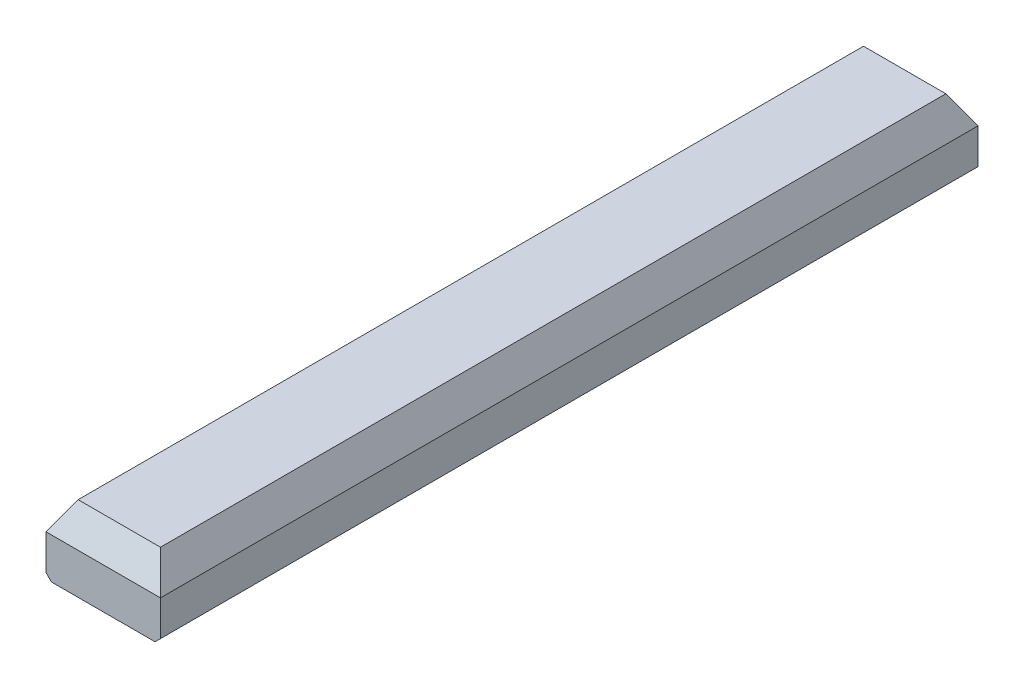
from build123d import *

# Parameters (mm, degrees)
SKETCH2_W           = 189.8015
SKETCH2_H           = 316.865
BOSS_EXTRUDE1_DEPTH = 1131.55
CHAMFER1_SIZE       = 15
CHAMFER2_SIZE       = 44.45
CHAMFER2_SIZE2      = 76.989658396


with BuildPart() as part:
    # Sketch2 → Boss-Extrude1 (new, symmetric)
    with BuildSketch(Plane(origin=(0, 0, 0), x_dir=(0, 1, 0), z_dir=(0, 0, 1))):
        with Locations((96.48825, 0)):
            Rectangle(SKETCH2_W, SKETCH2_H)
    extrude(amount=BOSS_EXTRUDE1_DEPTH, both=True)

    # Chamfer1
    chamfer1_edges = [part.edges().sort_by_distance(p)[0] for p in [
        (158.4325, 1.5875, 0),
        (-158.4325, 1.5875, 0),
    ]]
    chamfer(chamfer1_edges, length=CHAMFER1_SIZE)

    # Chamfer2
    chamfer2_edges = [part.edges().sort_by_distance(p)[0] for p in [
        (0, 191.389, 1131.55),
        (0, 191.389, -1131.55),
        (158.4325, 191.389, 0),
        (-158.4325, 191.389, 0),
    ]]
    chamfer2_side = [part.faces().sort_by_distance(p)[0] for p in [
        (0, 191.389, 0),
    ]]
    chamfer(chamfer2_edges, length=CHAMFER2_SIZE, length2=CHAMFER2_SIZE2, reference=chamfer2_side[0])


solid = part.part
